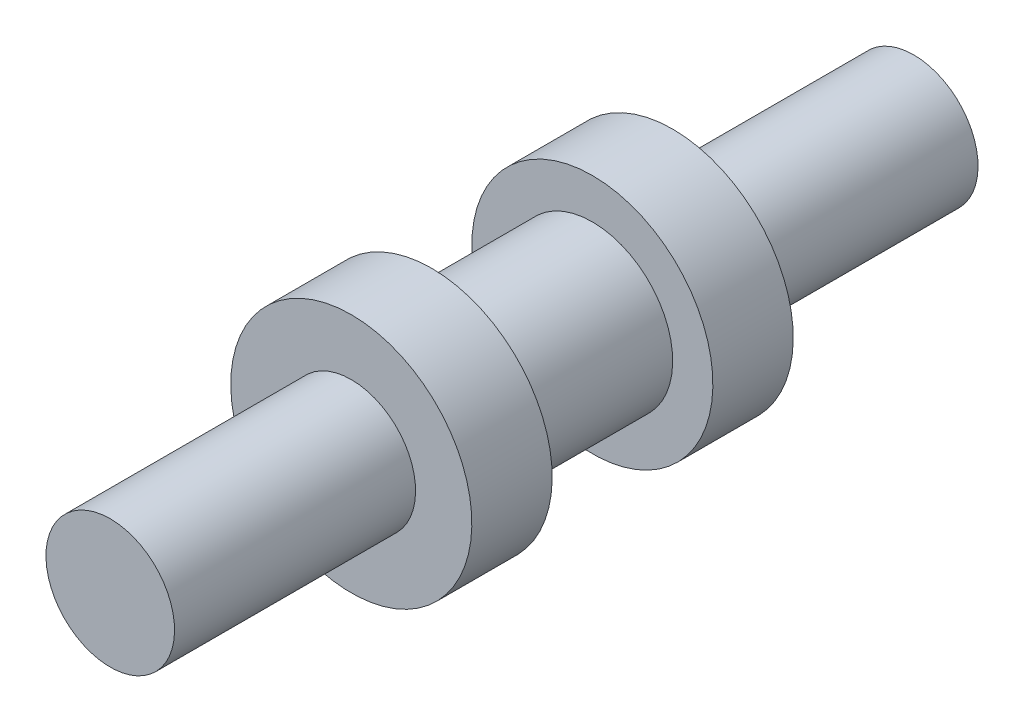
from build123d import *


with BuildPart() as part:
    # Sketch1 → Revolve1 (revolve)
    with BuildSketch(Plane(origin=(0, 0, 0), x_dir=(0, 0, -1), z_dir=(1, 0, 0))):
        Polygon((-6.35, 6.35), (6.35, 6.35), (6.35, 9.525), (12.7, 9.525), (12.7, 5.08), (31.75, 5.08), (31.75, 0), (-31.75, 0), (-31.75, 5.08), (-12.7, 5.08), (-12.7, 9.525), (-6.35, 9.525), align=None)
    revolve(axis=Axis((0, 0, -31.75), (0, 0, 1)))


solid = part.part
